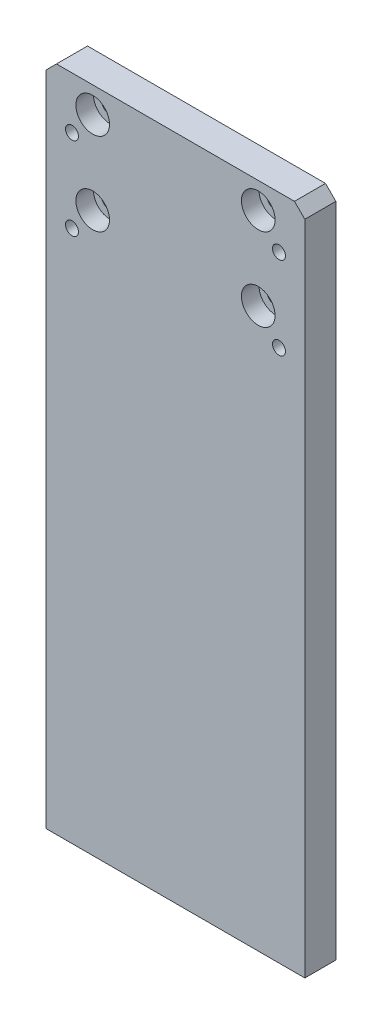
from build123d import *

# Parameters (mm, degrees)
SKETCH1_W                                           = 50
SKETCH1_H                                           = 129
EXTRUDE1_DEPTH                                      = 3
CBORE_FOR_M3_HEX_SOCKET_HEAD_CAP_SCREW1_D           = 3.4
CBORE_FOR_M3_HEX_SOCKET_HEAD_CAP_SCREW1_CBORE_D     = 6.5
CBORE_FOR_M3_HEX_SOCKET_HEAD_CAP_SCREW1_CBORE_DEPTH = 3.4
M3_TAPPED_HOLE1_D                                   = 2.5
HOLEWZD1_D                                          = 3.5
HOLEWZD1_DEPTH                                      = 6
M4_TAPPED_HOLE1_D                                   = 3.3
M4_TAPPED_HOLE1_DEPTH                               = 11.5
M4_TAPPED_HOLE1_TIP                                 = 0.991420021
CHAMFER1_SIZE                                       = 2


with BuildPart() as part:
    # Sketch1 → Extrude1 (new, symmetric)
    with BuildSketch(Plane.XY):
        with Locations((0, 64.5)):
            Rectangle(SKETCH1_W, SKETCH1_H)
    extrude(amount=EXTRUDE1_DEPTH, both=True)

    # CBORE for M3 Hex Socket Head Cap Screw1 (through all)
    with Locations(Plane.XY.offset(3)):
        with Locations((-16, 108), (16, 124), (16, 108), (-16, 124)):
            CounterBoreHole(CBORE_FOR_M3_HEX_SOCKET_HEAD_CAP_SCREW1_D / 2, CBORE_FOR_M3_HEX_SOCKET_HEAD_CAP_SCREW1_CBORE_D / 2, CBORE_FOR_M3_HEX_SOCKET_HEAD_CAP_SCREW1_CBORE_DEPTH)

    # M3 Tapped Hole1 (through all)
    with Locations(Plane.XY.offset(3)):
        with Locations((-20, 119), (20, 119), (-20, 103), (20, 103)):
            Hole(M3_TAPPED_HOLE1_D / 2)

    # HoleWzd1
    with Locations(Plane.XY.offset(3)):
        with Locations((-16, 124), (16, 108), (16, 124), (-16, 108)):
            Hole(HOLEWZD1_D / 2, depth=HOLEWZD1_DEPTH)

    # M4 Tapped Hole1
    with Locations(Plane(origin=(0, 0, 0), x_dir=(-1, 0, 0), z_dir=(0, -1, 0))):
        with Locations((-20, 0), (20, 0)):
            Hole(M4_TAPPED_HOLE1_D / 2, depth=M4_TAPPED_HOLE1_DEPTH)
            with Locations((0, 0, -(M4_TAPPED_HOLE1_DEPTH + M4_TAPPED_HOLE1_TIP / 2))):  # 118° drill point
                Cone(0, M4_TAPPED_HOLE1_D / 2, M4_TAPPED_HOLE1_TIP, mode=Mode.SUBTRACT)

    # Chamfer1
    chamfer1_edges = [part.edges().sort_by_distance(p)[0] for p in [
        (-25, 129, 0),
        (25, 129, 0),
    ]]
    chamfer(chamfer1_edges, length=CHAMFER1_SIZE)


solid = part.part
